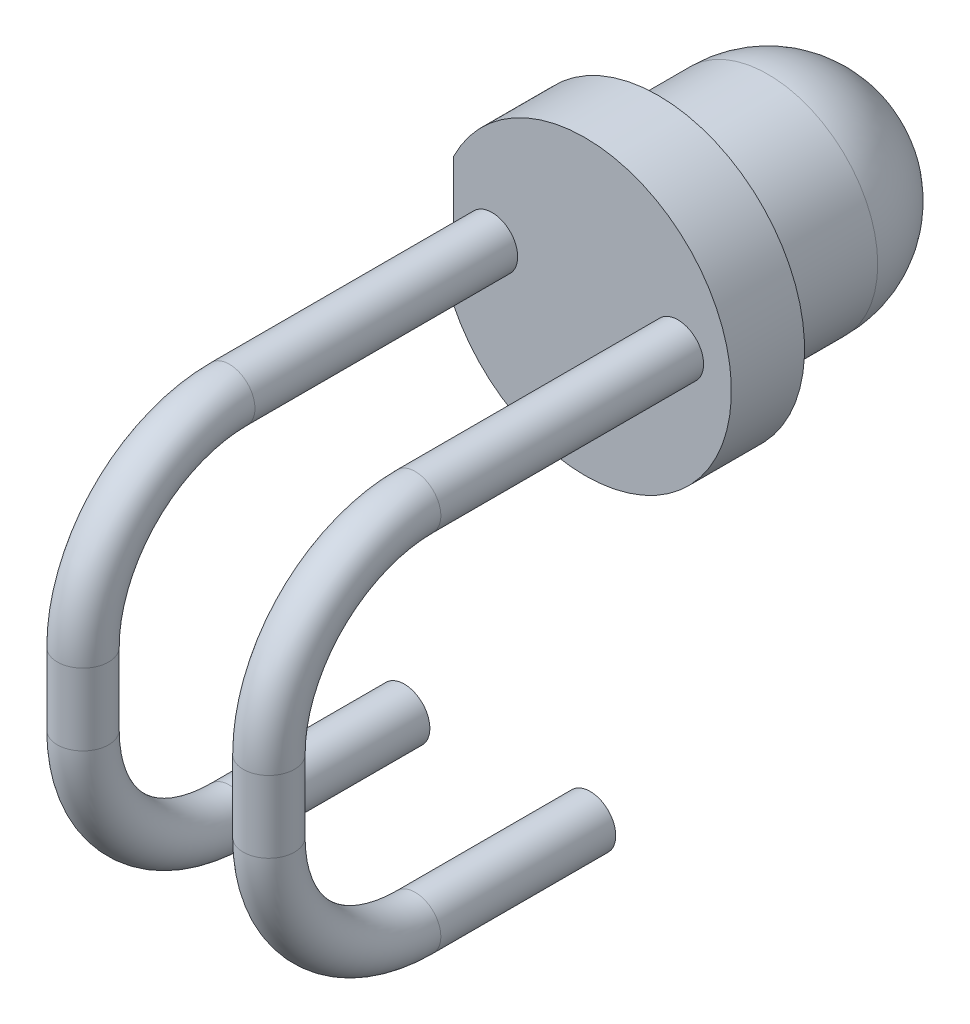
from build123d import *

# Parameters (mm, degrees)
ESQUISSE1_R                = 1.5
BASE_EXTRUSION_DEPTH       = 4
BOSS_EXTRU_1_DEPTH         = 1
CONG_1_R                   = 1.5
ESQUISSE10_R               = 0.35
R_P_TITION_LIN_AIRE1_COUNT = 2
R_P_TITION_LIN_AIRE1_PITCH = 2.54


with BuildPart() as part:
    # Esquisse1 → Base-Extrusion (new body)
    with BuildSketch(Plane.XY):
        Circle(ESQUISSE1_R)
    extrude(amount=BASE_EXTRUSION_DEPTH)

    # Esquisse2 → Boss.-Extru.1 (add)
    with BuildSketch(Plane.XY.offset(4)):
        with BuildLine():
            Line((-1.8, 0.871779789), (-1.8, -0.871779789))
            ThreePointArc((-1.8, -0.871779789), (2, 0), (-1.8, 0.871779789))
        make_face()
    extrude(amount=-BOSS_EXTRU_1_DEPTH)

    # Cong_1
    cong_1_edges = [part.edges().sort_by_distance(p)[0] for p in [
        (-1.5, 0, 0),
    ]]
    fillet(cong_1_edges, radius=CONG_1_R)

    # Balayage1: sweep along a path in Esquisse9
    with BuildLine(Plane(origin=(1.27, 0, 0), x_dir=(0, 0, -1), z_dir=(1, 0, 0))) as balayage1_path:
        Line((-4, 0.128695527), (-7.59, 0.128695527))
        ThreePointArc((-7.59, 0.128695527), (-9.004213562, -0.457090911), (-9.59, -1.871304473))
        Line((-9.59, -1.871304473), (-9.59, -2.851304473))
        ThreePointArc((-9.59, -2.851304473), (-9.004213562, -4.265518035), (-7.59, -4.851304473))
        Line((-7.59, -4.851304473), (-5.2, -4.851304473))
    # Esquisse10 → Balayage1 (sweep)
    with BuildSketch(Plane.XY.offset(4)):
        with Locations((1.27, 0.128695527)):
            Circle(ESQUISSE10_R)
    balayage1 = sweep(path=balayage1_path.line)

    # R_p_tition lin_aire1: Balayage1 ×2
    with Locations(*[(-i * R_P_TITION_LIN_AIRE1_PITCH, 0, 0) for i in range(1, R_P_TITION_LIN_AIRE1_COUNT)]):
        add(balayage1)


solid = part.part
